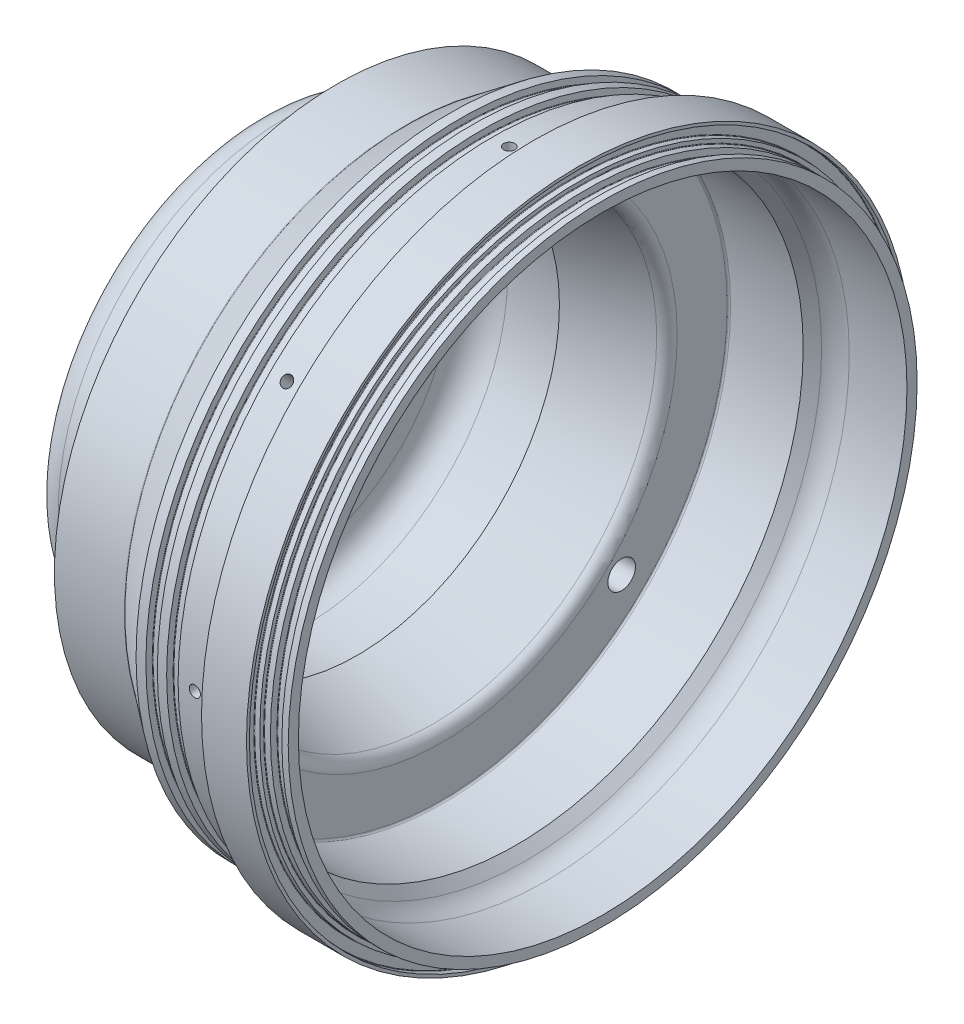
from build123d import *

# Parameters (mm, degrees)
SKETCH4_R           = 152.4
SKETCH4_R_2         = 139.7
BOSS_EXTRUDE1_DEPTH = 15.875
SKETCH5_R           = 144.3609
SKETCH5_R_2         = 139.7
BOSS_EXTRUDE2_DEPTH = 38.1
SKETCH8_R           = 6.35
CUT_EXTRUDE1_DEPTH  = 248.783436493
CIRPATTERN2_COUNT   = 8
FILLET1_R           = 5.55625
FILLET2_R           = 12.7
FILLET4_R           = 0.79375
FILLET5_R           = 0.254
SKETCH12_R          = 25.4
BOSS_EXTRUDE3_DEPTH = 9.525
FILLET3_R           = 4.7625
CUT_EXTRUDE2_DEPTH  = 262.028727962
SKETCH_92479A820_W  = 0.7874
SKETCH_92479A820_H  = 0.5334


with BuildPart() as part:
    # Sketch1 → Revolve1 (revolve)
    with BuildSketch(Plane.XY, mode=Mode.PRIVATE) as revolve1_sk:
        Polygon((0, 152.4), (0, 144.3609), (11.1252, 144.3609), (11.1252, 139.7), (-4.7625, 139.7), (-4.7625, 143.891), (-4.7625, 152.4), align=None)
    revolve(revolve1_sk.sketch.rotate(Axis((0, 0, 0), (1, 0, 0)), 90), axis=Axis((0, 0, 0), (1, 0, 0)))

    # Sketch4 → Boss-Extrude1 (add)
    with BuildSketch(Plane.ZY.offset(4.7625)):
        Circle(SKETCH4_R)
        Circle(SKETCH4_R_2, mode=Mode.SUBTRACT)
    extrude(amount=BOSS_EXTRUDE1_DEPTH)

    # Sketch5 → Boss-Extrude2 (add)
    with BuildSketch(Plane.ZY.offset(20.6375)):
        Circle(SKETCH5_R)
        Circle(SKETCH5_R_2, mode=Mode.SUBTRACT)
    extrude(amount=BOSS_EXTRUDE2_DEPTH)

    # Sketch2 → Cut-Revolve 2-277 (revolve, cut)
    with BuildSketch(Plane.XY, mode=Mode.PRIVATE) as cut_revolve_2_277_sk:
        with BuildLine():
            Line((0, 151.0665), (-2.3114, 151.0665))
            ThreePointArc((-2.3114, 151.0665), (-2.491005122, 150.992105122), (-2.5654, 150.8125))
            Line((-2.5654, 150.8125), (-2.5654, 146.558))
            ThreePointArc((-2.5654, 146.558), (-2.491005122, 146.378394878), (-2.3114, 146.304))
            Line((-2.3114, 146.304), (0, 146.304))
            Line((0, 146.304), (0, 151.0665))
        make_face()
    revolve(cut_revolve_2_277_sk.sketch.rotate(Axis((0, 0, 0), (-1, 0, 0)), 90), axis=Axis((0, 0, 0), (-1, 0, 0)), mode=Mode.SUBTRACT)

    # Sketch3 → Cut-Revolve 2-276 (revolve, cut)
    with BuildSketch(Plane.XY, mode=Mode.PRIVATE) as cut_revolve_2_276_sk:
        with BuildLine():
            Line((8.202421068, 144.3609), (2.948178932, 144.3609))
            Line((2.948178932, 144.3609), (3.180114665, 141.709862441))
            ThreePointArc((3.180114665, 141.709862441), (3.261548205, 141.544731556), (3.433148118, 141.478))
            Line((3.433148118, 141.478), (7.717451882, 141.478))
            ThreePointArc((7.717451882, 141.478), (7.889051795, 141.544731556), (7.970485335, 141.709862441))
            Line((7.970485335, 141.709862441), (8.202421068, 144.3609))
        make_face()
        with BuildLine():
            Line((-39.435278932, 144.3609), (-44.689521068, 144.3609))
            Line((-44.689521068, 144.3609), (-44.457585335, 141.709862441))
            ThreePointArc((-44.457585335, 141.709862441), (-44.376151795, 141.544731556), (-44.204551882, 141.478))
            Line((-44.204551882, 141.478), (-39.920248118, 141.478))
            ThreePointArc((-39.920248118, 141.478), (-39.748648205, 141.544731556), (-39.667214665, 141.709862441))
            Line((-39.667214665, 141.709862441), (-39.435278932, 144.3609))
        make_face()
        with BuildLine():
            Line((-48.972978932, 144.3609), (-54.227221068, 144.3609))
            Line((-54.227221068, 144.3609), (-53.995285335, 141.709862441))
            ThreePointArc((-53.995285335, 141.709862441), (-53.913851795, 141.544731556), (-53.742251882, 141.478))
            Line((-53.742251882, 141.478), (-49.457948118, 141.478))
            ThreePointArc((-49.457948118, 141.478), (-49.286348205, 141.544731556), (-49.204914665, 141.709862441))
            Line((-49.204914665, 141.709862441), (-48.972978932, 144.3609))
        make_face()
    revolve(cut_revolve_2_276_sk.sketch.rotate(Axis((0, 0, 0), (1, 0, 0)), 90), axis=Axis((0, 0, 0), (1, 0, 0)), mode=Mode.SUBTRACT)

    # Sketch7 → Revolve2 (revolve)
    with BuildSketch(Plane.XY, mode=Mode.PRIVATE) as revolve2_sk:
        with BuildLine():
            Line((-111.125, 103.85425), (-134.9375, 103.85425))
            ThreePointArc((-134.9375, 103.85425), (-143.917756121, 100.134506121), (-147.6375, 91.15425))
            Line((-147.6375, 91.15425), (-147.6375, 0))
            Line((-147.6375, 0), (-138.1125, 0))
            Line((-138.1125, 0), (-138.1125, 80.16875))
            ThreePointArc((-138.1125, 80.16875), (-134.392756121, 89.149006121), (-125.4125, 92.86875))
            Line((-125.4125, 92.86875), (-101.6, 92.86875))
            Line((-101.6, 92.86875), (-62.7126, 103.8479))
            Line((-62.7126, 103.8479), (-62.7126, 131.7625))
            Line((-62.7126, 131.7625), (-58.7375, 131.7625))
            Line((-58.7375, 131.7625), (-28.575, 131.7625))
            Line((-28.575, 131.7625), (-20.6375, 139.7))
            Line((-20.6375, 139.7), (-58.7375, 139.7))
            Line((-58.7375, 139.7), (-58.7375, 144.3609))
            Line((-58.7375, 144.3609), (-78.7908, 129.4384))
            Line((-78.7908, 129.4384), (-111.125, 129.4384))
            Line((-111.125, 129.4384), (-111.125, 103.85425))
        make_face()
    revolve(revolve2_sk.sketch.rotate(Axis((0, 0, 0), (-1, 0, 0)), 90), axis=Axis((0, 0, 0), (-1, 0, 0)))

    # Sketch8 → Cut-Extrude1 (cut, through all)
    with BuildSketch(Plane.ZY.offset(111.125)):
        with Locations(Location((82.546514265, 82.546514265, 0), (0, 0, 270))):
            Circle(SKETCH8_R)
        with Locations(Location((82.546514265, -82.546514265, 0), (0, 0, 270))):
            Circle(SKETCH8_R)
        with Locations(Location((-82.546514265, -82.546514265, 0), (0, 0, 270))):
            Circle(SKETCH8_R)
        with Locations(Location((-82.546514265, 82.546514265, 0), (0, 0, 270))):
            Circle(SKETCH8_R)
    extrude(amount=-CUT_EXTRUDE1_DEPTH, mode=Mode.SUBTRACT)

    # Sketch11 → Cut-Revolve2 (revolve, cut)
    with BuildSketch(Plane.XY, mode=Mode.PRIVATE) as cut_revolve2_sk:
        Polygon((-29.1973, 144.3609), (-29.1973, 135.62965), (-31.75, 134.095833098), (-31.75, 144.3609), align=None)
    cut_revolve2 = revolve(cut_revolve2_sk.sketch.rotate(Axis((-31.75, 144.3609, 0), (0, -1, 0)), 90), axis=Axis((-31.75, 144.3609, 0), (0, -1, 0)), mode=Mode.SUBTRACT)

    # CirPattern2: Cut-Revolve2 ×8 about axis
    cirpattern2_axis = Axis((0, 0, 0), (-1, 0, 0))
    for i in range(1, CIRPATTERN2_COUNT):
        add(cut_revolve2.rotate(cirpattern2_axis, i * 360 / CIRPATTERN2_COUNT), mode=Mode.SUBTRACT)

    # Fillet1
    fillet1_edges = [part.edges().sort_by_distance(p)[0] for p in [
        (-62.7126, 0, 103.8479),
    ]]
    fillet(fillet1_edges, radius=FILLET1_R)

    # Fillet2
    fillet2_edges = [part.edges().sort_by_distance(p)[0] for p in [
        (-20.6375, -139.7, 0),
    ]]
    fillet(fillet2_edges, radius=FILLET2_R)

    # Fillet4
    fillet4_edges = [part.edges().sort_by_distance(p)[0] for p in [
        (-62.7126, 0, 131.7625),
        (-78.7908, 0, 129.4384),
        (-111.125, 0, 103.85425),
    ]]
    fillet(fillet4_edges, radius=FILLET4_R)

    # Fillet5
    fillet5_edges = [part.edges().sort_by_distance(p)[0] for p in [
        (-20.6375, 0, -144.3609),
        (0, 0, -144.3609),
    ]]
    fillet(fillet5_edges, radius=FILLET5_R)

    # Sketch12 → Boss-Extrude3 (add)
    with BuildSketch(Plane(origin=(-138.1125, 0, 0), x_dir=(0, 0, -1), z_dir=(1, 0, 0))):
        with Locations((0, 44.45)):
            Circle(SKETCH12_R)
    extrude(amount=BOSS_EXTRUDE3_DEPTH)

    # Fillet3
    fillet3_edges = [part.edges().sort_by_distance(p)[0] for p in [
        (-138.1125, 44.45, 25.4),
    ]]
    fillet(fillet3_edges, radius=FILLET3_R)

    # Sketch 2-029 → Impulse Cut (revolve, cut)
    with BuildSketch(Plane.XY):
        Polygon((-147.6375, 63.5254), (-142.08125, 63.5254), (-142.08125, 64.77), (-139.71905, 64.77), (-139.71905, 63.5254), (-136.1313, 63.5254), (-136.1313, 60.3504), (-125.4125, 60.3504), (-125.4125, 44.45), (-147.6375, 44.45), align=None)
    revolve(axis=Axis((-147.6375, 44.45, 0), (-1, 0, 0)), mode=Mode.SUBTRACT)

    # Sketch15 → Cut-Extrude2 (cut, through all)
    with BuildSketch(Plane.ZY.offset(136.1313)):
        with BuildLine():
            Line((2.3876, 60.3504), (2.3876, 43.171624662))
            Line((2.3876, 43.171624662), (-2.3876, 43.171624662))
            Line((-2.3876, 43.171624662), (-2.3876, 60.3504))
            ThreePointArc((-2.3876, 60.3504), (0, 62.738), (2.3876, 60.3504))
        make_face()
    extrude(amount=-CUT_EXTRUDE2_DEPTH, mode=Mode.SUBTRACT)

    # Sketch 92479A820 → Spring Ring Cut (revolve, cut)
    with BuildSketch(Plane.XY):
        with Locations((-146.1008, 63.7921)):
            Rectangle(SKETCH_92479A820_W, SKETCH_92479A820_H)
    revolve(axis=Axis((-146.254727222, 44.45, 0), (-1, 0, 0)), mode=Mode.SUBTRACT)


solid = part.part
